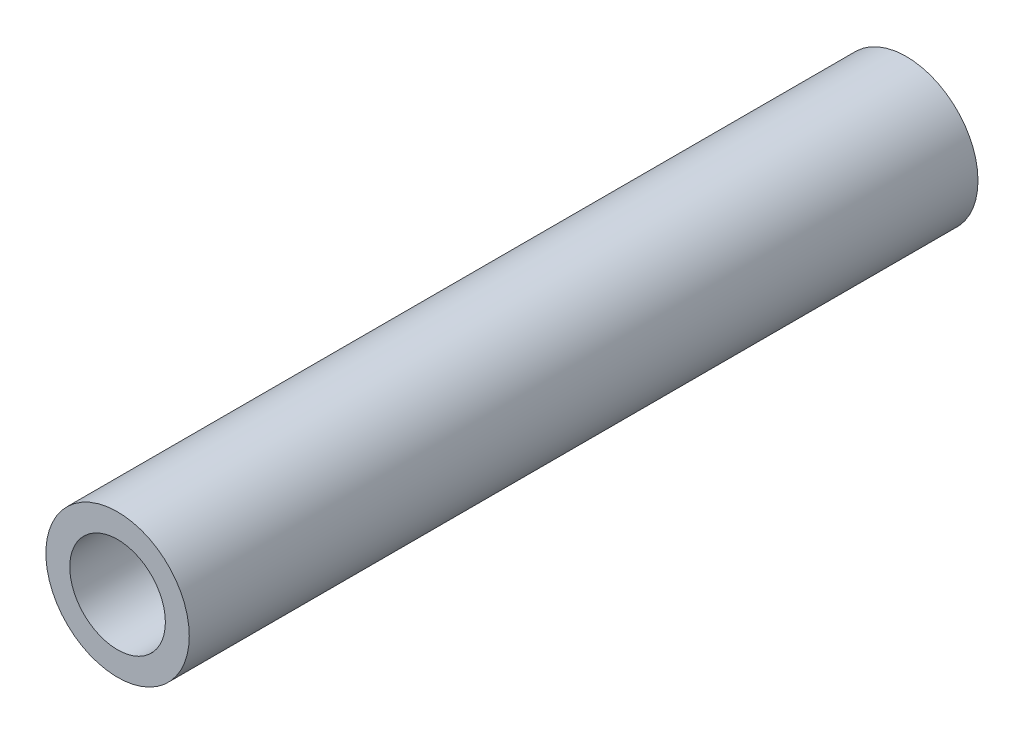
ISO-10303-21;
HEADER;
FILE_DESCRIPTION(('STEP AP214'),'2;1');
FILE_NAME('part.step','',(''),(''),'','','');
FILE_SCHEMA(('AUTOMOTIVE_DESIGN { 1 0 10303 214 1 1 1 1 }'));
ENDSEC;
DATA;
#1=APPLICATION_CONTEXT('core data for automotive mechanical design processes');
#2=APPLICATION_PROTOCOL_DEFINITION('international standard','automotive_design',2000,#1);
#3=PRODUCT_CONTEXT('',#1,'mechanical');
#4=PRODUCT('Part','Part','',(#3));
#5=PRODUCT_RELATED_PRODUCT_CATEGORY('part','',(#4));
#6=PRODUCT_DEFINITION_FORMATION('','',#4);
#7=PRODUCT_DEFINITION_CONTEXT('part definition',#1,'design');
#8=PRODUCT_DEFINITION('design','',#6,#7);
#9=PRODUCT_DEFINITION_SHAPE('','',#8);
#10=(LENGTH_UNIT() NAMED_UNIT(*) SI_UNIT(.MILLI.,.METRE.));
#11=(NAMED_UNIT(*) PLANE_ANGLE_UNIT() SI_UNIT($,.RADIAN.));
#12=(NAMED_UNIT(*) SI_UNIT($,.STERADIAN.) SOLID_ANGLE_UNIT());
#13=UNCERTAINTY_MEASURE_WITH_UNIT(LENGTH_MEASURE(1.E-05),#10,'distance_accuracy_value','');
#14=(GEOMETRIC_REPRESENTATION_CONTEXT(3) GLOBAL_UNCERTAINTY_ASSIGNED_CONTEXT((#13)) GLOBAL_UNIT_ASSIGNED_CONTEXT((#10,
#11,#12)) REPRESENTATION_CONTEXT('',''));
#15=CARTESIAN_POINT('',(0.,0.,0.));
#16=DIRECTION('',(0.,0.,1.));
#17=DIRECTION('',(1.,0.,0.));
#18=AXIS2_PLACEMENT_3D('',#15,#16,#17);
#19=CARTESIAN_POINT('',(0.,0.,33.));
#20=DIRECTION('',(0.,0.,-1.));
#21=DIRECTION('',(-1.,0.,0.));
#22=AXIS2_PLACEMENT_3D('',#19,#20,#21);
#23=CYLINDRICAL_SURFACE('',#22,3.);
#24=CARTESIAN_POINT('',(0.,0.,33.));
#25=DIRECTION('',(0.,0.,1.));
#26=DIRECTION('',(1.,0.,0.));
#27=AXIS2_PLACEMENT_3D('',#24,#25,#26);
#28=CIRCLE('',#27,3.);
#29=CARTESIAN_POINT('',(3.,0.,33.));
#30=VERTEX_POINT('',#29);
#31=EDGE_CURVE('E11',#30,#30,#28,.T.);
#32=ORIENTED_EDGE('',*,*,#31,.F.);
#33=EDGE_LOOP('',(#32));
#34=FACE_BOUND('',#33,.T.);
#35=CARTESIAN_POINT('',(0.,0.,0.));
#36=DIRECTION('',(0.,0.,1.));
#37=DIRECTION('',(1.,0.,0.));
#38=AXIS2_PLACEMENT_3D('',#35,#36,#37);
#39=CIRCLE('',#38,3.);
#40=CARTESIAN_POINT('',(3.,0.,0.));
#41=VERTEX_POINT('',#40);
#42=EDGE_CURVE('E33',#41,#41,#39,.T.);
#43=ORIENTED_EDGE('',*,*,#42,.T.);
#44=EDGE_LOOP('',(#43));
#45=FACE_BOUND('',#44,.T.);
#46=ADVANCED_FACE('F27',(#34,#45),#23,.T.);
#47=CARTESIAN_POINT('',(0.,0.,33.));
#48=DIRECTION('',(0.,0.,1.));
#49=DIRECTION('',(1.,0.,0.));
#50=AXIS2_PLACEMENT_3D('',#47,#48,#49);
#51=PLANE('',#50);
#52=CARTESIAN_POINT('',(0.,0.,33.));
#53=DIRECTION('',(0.,0.,1.));
#54=DIRECTION('',(1.,0.,0.));
#55=AXIS2_PLACEMENT_3D('',#52,#53,#54);
#56=CIRCLE('',#55,2.);
#57=CARTESIAN_POINT('',(2.,0.,33.));
#58=VERTEX_POINT('',#57);
#59=EDGE_CURVE('E45',#58,#58,#56,.T.);
#60=ORIENTED_EDGE('',*,*,#59,.F.);
#61=EDGE_LOOP('',(#60));
#62=FACE_BOUND('',#61,.T.);
#63=ORIENTED_EDGE('',*,*,#31,.T.);
#64=EDGE_LOOP('',(#63));
#65=FACE_BOUND('',#64,.T.);
#66=ADVANCED_FACE('F55',(#62,#65),#51,.T.);
#67=CARTESIAN_POINT('',(0.,0.,0.));
#68=DIRECTION('',(0.,0.,1.));
#69=DIRECTION('',(1.,0.,0.));
#70=AXIS2_PLACEMENT_3D('',#67,#68,#69);
#71=PLANE('',#70);
#72=ORIENTED_EDGE('',*,*,#42,.F.);
#73=EDGE_LOOP('',(#72));
#74=FACE_BOUND('',#73,.T.);
#75=ADVANCED_FACE('F53',(#74),#71,.F.);
#76=CARTESIAN_POINT('',(0.,0.,22.));
#77=DIRECTION('',(0.,0.,1.));
#78=DIRECTION('',(1.,0.,0.));
#79=AXIS2_PLACEMENT_3D('',#76,#77,#78);
#80=CYLINDRICAL_SURFACE('',#79,2.);
#81=CARTESIAN_POINT('',(0.,0.,22.));
#82=DIRECTION('',(0.,0.,1.));
#83=DIRECTION('',(1.,0.,0.));
#84=AXIS2_PLACEMENT_3D('',#81,#82,#83);
#85=CIRCLE('',#84,2.);
#86=CARTESIAN_POINT('',(2.,0.,22.));
#87=VERTEX_POINT('',#86);
#88=EDGE_CURVE('E43',#87,#87,#85,.T.);
#89=ORIENTED_EDGE('',*,*,#88,.F.);
#90=EDGE_LOOP('',(#89));
#91=FACE_BOUND('',#90,.T.);
#92=ORIENTED_EDGE('',*,*,#59,.T.);
#93=EDGE_LOOP('',(#92));
#94=FACE_BOUND('',#93,.T.);
#95=ADVANCED_FACE('F39',(#91,#94),#80,.F.);
#96=CARTESIAN_POINT('',(0.,0.,22.));
#97=DIRECTION('',(0.,0.,1.));
#98=DIRECTION('',(1.,0.,0.));
#99=AXIS2_PLACEMENT_3D('',#96,#97,#98);
#100=CONICAL_SURFACE('',#99,2.,1.11043277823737);
#101=CARTESIAN_POINT('',(0.,0.,21.0081967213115));
#102=VERTEX_POINT('',#101);
#103=VERTEX_LOOP('',#102);
#104=FACE_BOUND('',#103,.T.);
#105=ORIENTED_EDGE('',*,*,#88,.T.);
#106=EDGE_LOOP('',(#105));
#107=FACE_BOUND('',#106,.T.);
#108=ADVANCED_FACE('F36',(#104,#107),#100,.F.);
#109=CLOSED_SHELL('',(#46,#66,#75,#95,#108));
#110=MANIFOLD_SOLID_BREP('B2',#109);
#111=ADVANCED_BREP_SHAPE_REPRESENTATION('',(#18,#110),#14);
#112=SHAPE_DEFINITION_REPRESENTATION(#9,#111);
ENDSEC;
END-ISO-10303-21;
